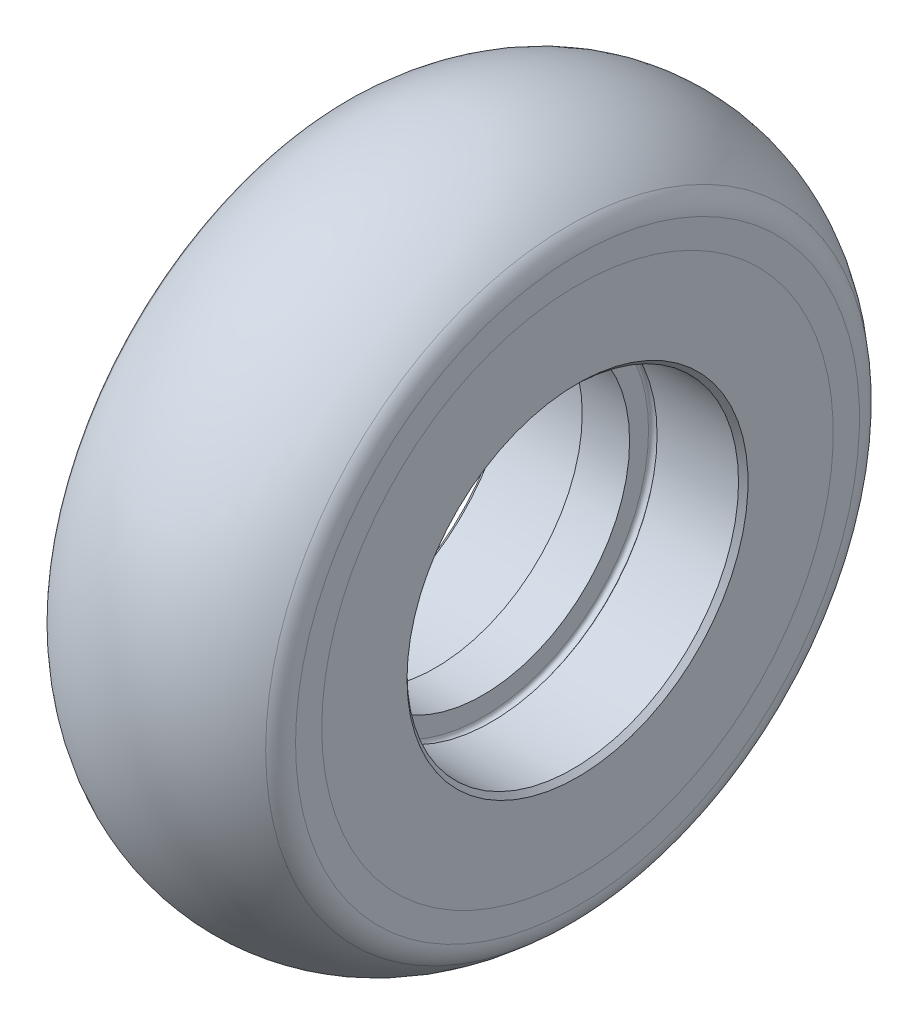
from build123d import *


with BuildPart() as part:
    # Sketch 1 → Revolve 1 (revolve)
    with BuildSketch(Plane(origin=(0, 0, 0), x_dir=(1, 0, 0), z_dir=(0, 1, 0)), mode=Mode.PRIVATE) as revolve_1_sk:
        with BuildLine():
            Line((-12.5, 27), (-12.5, 18))
            Line((-12.5, 18), (-12, 17.5))
            Line((-12, 17.5), (-3.401217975, 17.5))
            Line((-3.401217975, 17.5), (-3.21922239, 17.741033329))
            ThreePointArc((-3.21922239, 17.741033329), (-2.772895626, 17.879268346), (-2.5, 17.5))
            Line((-2.5, 17.5), (-2.5, 15.5))
            Line((-2.5, 15.5), (2.5, 15.5))
            Line((2.5, 15.5), (2.5, 17.5))
            ThreePointArc((2.5, 17.5), (2.772895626, 17.879268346), (3.21922239, 17.741033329))
            Line((3.21922239, 17.741033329), (3.401217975, 17.5))
            Line((3.401217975, 17.5), (12, 17.5))
            Line((12, 17.5), (12.5, 18))
            Line((12.5, 18), (12.5, 27))
            Line((12.5, 27), (12, 27.5))
            Line((12, 27.5), (8.436749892, 27.5))
            ThreePointArc((8.436749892, 27.5), (7.588439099, 27.688821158), (6.900307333, 28.219631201))
            Line((6.900307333, 28.219631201), (5.599692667, 29.780368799))
            ThreePointArc((5.599692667, 29.780368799), (4.911560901, 30.311178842), (4.063250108, 30.5))
            Line((4.063250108, 30.5), (-4.063250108, 30.5))
            ThreePointArc((-4.063250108, 30.5), (-4.911560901, 30.311178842), (-5.599692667, 29.780368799))
            Line((-5.599692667, 29.780368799), (-6.900307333, 28.219631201))
            ThreePointArc((-6.900307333, 28.219631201), (-7.588439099, 27.688821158), (-8.436749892, 27.5))
            Line((-8.436749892, 27.5), (-12, 27.5))
            Line((-12, 27.5), (-12.5, 27))
        make_face()
    revolve(revolve_1_sk.sketch.rotate(Axis((-16.407604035, 0, 0), (1, 0, 0)), 180), axis=Axis((-16.407604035, 0, 0), (1, 0, 0)))


with BuildPart() as body_2:
    # Sketch 2 → Revolve 2 (revolve)
    with BuildSketch(Plane(origin=(0, 0, 0), x_dir=(1, 0, 0), z_dir=(0, 1, 0)), mode=Mode.PRIVATE) as revolve_2_sk:
        with BuildLine():
            Line((-12, 27.5), (-12.5, 27))
            Line((-12.5, 27), (-12.5, 29.766968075))
            ThreePointArc((-12.5, 29.766968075), (-12.250185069, 30.965501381), (-11.542345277, 31.96442701))
            ThreePointArc((-11.542345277, 31.96442701), (0, 36.5), (11.542345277, 31.96442701))
            ThreePointArc((11.542345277, 31.96442701), (12.250185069, 30.965501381), (12.5, 29.766968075))
            Line((12.5, 29.766968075), (12.5, 27))
            Line((12.5, 27), (12, 27.5))
            Line((12, 27.5), (8.436749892, 27.5))
            ThreePointArc((8.436749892, 27.5), (7.588439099, 27.688821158), (6.900307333, 28.219631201))
            Line((6.900307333, 28.219631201), (5.599692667, 29.780368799))
            ThreePointArc((5.599692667, 29.780368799), (4.911560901, 30.311178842), (4.063250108, 30.5))
            Line((4.063250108, 30.5), (-4.063250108, 30.5))
            ThreePointArc((-4.063250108, 30.5), (-4.911560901, 30.311178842), (-5.599692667, 29.780368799))
            Line((-5.599692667, 29.780368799), (-6.900307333, 28.219631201))
            ThreePointArc((-6.900307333, 28.219631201), (-7.588439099, 27.688821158), (-8.436749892, 27.5))
            Line((-8.436749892, 27.5), (-12, 27.5))
        make_face()
    revolve(revolve_2_sk.sketch.rotate(Axis((-16.407604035, 0, 0), (1, 0, 0)), 180), axis=Axis((-16.407604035, 0, 0), (1, 0, 0)))


solid = Compound([part.part, body_2.part])
